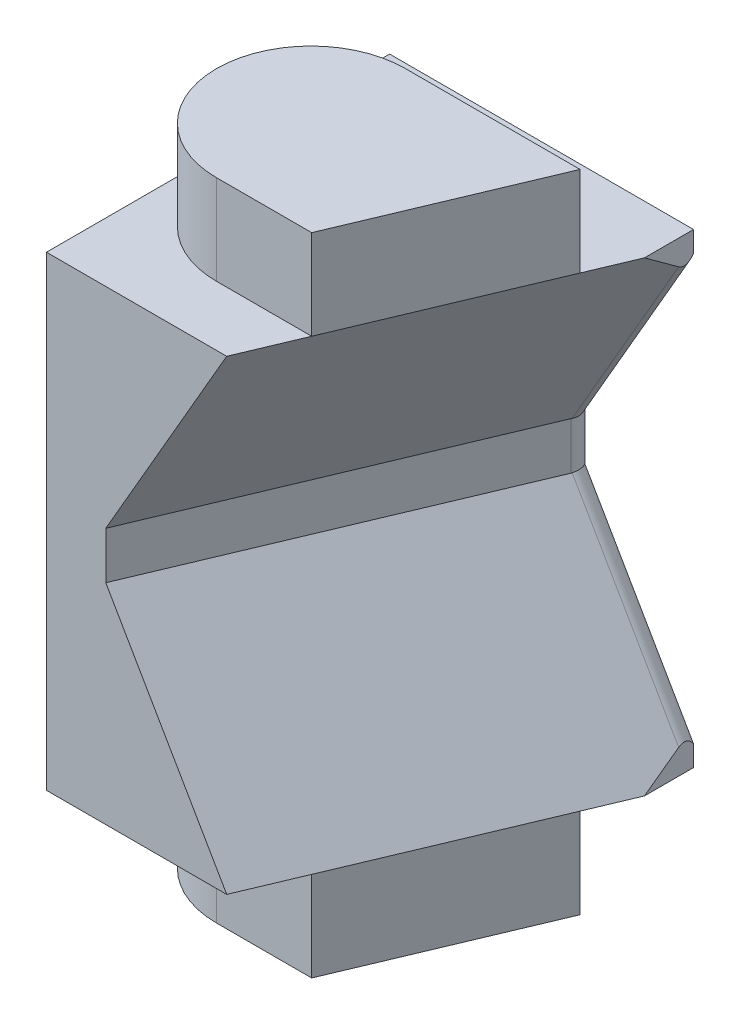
ISO-10303-21;
HEADER;
FILE_DESCRIPTION(('STEP AP214'),'2;1');
FILE_NAME('part.step','',(''),(''),'','','');
FILE_SCHEMA(('AUTOMOTIVE_DESIGN { 1 0 10303 214 1 1 1 1 }'));
ENDSEC;
DATA;
#1=APPLICATION_CONTEXT('core data for automotive mechanical design processes');
#2=APPLICATION_PROTOCOL_DEFINITION('international standard','automotive_design',2000,#1);
#3=PRODUCT_CONTEXT('',#1,'mechanical');
#4=PRODUCT('Part','Part','',(#3));
#5=PRODUCT_RELATED_PRODUCT_CATEGORY('part','',(#4));
#6=PRODUCT_DEFINITION_FORMATION('','',#4);
#7=PRODUCT_DEFINITION_CONTEXT('part definition',#1,'design');
#8=PRODUCT_DEFINITION('design','',#6,#7);
#9=PRODUCT_DEFINITION_SHAPE('','',#8);
#10=(LENGTH_UNIT() NAMED_UNIT(*) SI_UNIT(.MILLI.,.METRE.));
#11=(NAMED_UNIT(*) PLANE_ANGLE_UNIT() SI_UNIT($,.RADIAN.));
#12=(NAMED_UNIT(*) SI_UNIT($,.STERADIAN.) SOLID_ANGLE_UNIT());
#13=UNCERTAINTY_MEASURE_WITH_UNIT(LENGTH_MEASURE(1.E-05),#10,'distance_accuracy_value','');
#14=(GEOMETRIC_REPRESENTATION_CONTEXT(3) GLOBAL_UNCERTAINTY_ASSIGNED_CONTEXT((#13)) GLOBAL_UNIT_ASSIGNED_CONTEXT((#10,
#11,#12)) REPRESENTATION_CONTEXT('',''));
#15=CARTESIAN_POINT('',(0.,0.,0.));
#16=DIRECTION('',(0.,0.,1.));
#17=DIRECTION('',(1.,0.,0.));
#18=AXIS2_PLACEMENT_3D('',#15,#16,#17);
#19=CARTESIAN_POINT('',(10.5219452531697,-0.109025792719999,0.6));
#20=DIRECTION('',(-0.5,-0.866025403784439,0.));
#21=DIRECTION('',(-0.866025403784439,0.5,0.));
#22=AXIS2_PLACEMENT_3D('',#19,#20,#21);
#23=CYLINDRICAL_SURFACE('',#22,1.);
#24=DIRECTION('',(-0.5,-0.866025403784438,0.));
#25=VECTOR('',#24,1.);
#26=CARTESIAN_POINT('',(7.510431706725,-7.20450550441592,0.942020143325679));
#27=LINE('',#26,#25);
#28=CARTESIAN_POINT('',(12.5345716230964,1.49756009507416,0.942020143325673));
#29=VERTEX_POINT('',#28);
#30=CARTESIAN_POINT('',(19.3,13.2156257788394,0.942020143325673));
#31=VERTEX_POINT('',#30);
#32=EDGE_CURVE('E300',#29,#31,#27,.F.);
#33=ORIENTED_EDGE('',*,*,#32,.F.);
#34=CARTESIAN_POINT('',(11.5948790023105,1.74934997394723,0.6));
#35=DIRECTION('',(-0.258819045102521,-0.965925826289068,0.));
#36=DIRECTION('',(-0.965925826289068,0.258819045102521,0.));
#37=AXIS2_PLACEMENT_3D('',#34,#35,#36);
#38=ELLIPSE('',#37,1.03527618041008,1.);
#39=CARTESIAN_POINT('',(12.3948790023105,1.53499062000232,0.));
#40=VERTEX_POINT('',#39);
#41=EDGE_CURVE('E211',#40,#29,#38,.T.);
#42=ORIENTED_EDGE('',*,*,#41,.F.);
#43=DIRECTION('',(-0.5,-0.866025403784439,0.));
#44=VECTOR('',#43,1.);
#45=CARTESIAN_POINT('',(19.3,13.4950110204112,0.));
#46=LINE('',#45,#44);
#47=CARTESIAN_POINT('',(19.3,13.4950110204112,0.));
#48=VERTEX_POINT('',#47);
#49=EDGE_CURVE('E248',#48,#40,#46,.T.);
#50=ORIENTED_EDGE('',*,*,#49,.F.);
#51=CARTESIAN_POINT('',(19.3,15.0950110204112,0.6));
#52=DIRECTION('',(1.,0.,0.));
#53=DIRECTION('',(0.,-1.,0.));
#54=AXIS2_PLACEMENT_3D('',#51,#52,#53);
#55=ELLIPSE('',#54,2.,1.);
#56=EDGE_CURVE('E284',#31,#48,#55,.T.);
#57=ORIENTED_EDGE('',*,*,#56,.F.);
#58=EDGE_LOOP('',(#33,#42,#50,#57));
#59=FACE_BOUND('',#58,.T.);
#60=ADVANCED_FACE('F14',(#59),#23,.T.);
#61=CARTESIAN_POINT('',(11.5948790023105,3.325,0.6));
#62=DIRECTION('',(0.,-1.,0.));
#63=DIRECTION('',(-1.,0.,0.));
#64=AXIS2_PLACEMENT_3D('',#61,#62,#63);
#65=CYLINDRICAL_SURFACE('',#64,1.);
#66=CARTESIAN_POINT('',(11.5948790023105,0.379005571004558,0.6));
#67=DIRECTION('',(0.813797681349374,0.469846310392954,0.342020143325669));
#68=DIRECTION('',(0.433147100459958,-0.882748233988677,0.182041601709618));
#69=AXIS2_PLACEMENT_3D('',#66,#67,#68);
#70=ELLIPSE('',#69,2.12835554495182,1.);
#71=CARTESIAN_POINT('',(12.5345716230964,-1.49756009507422,0.942020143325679));
#72=VERTEX_POINT('',#71);
#73=CARTESIAN_POINT('',(12.516742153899,-1.49979652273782,0.987515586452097));
#74=VERTEX_POINT('',#73);
#75=EDGE_CURVE('E267',#72,#74,#70,.F.);
#76=ORIENTED_EDGE('',*,*,#75,.F.);
#77=CARTESIAN_POINT('',(11.5948790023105,-1.7493499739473,0.6));
#78=DIRECTION('',(0.258819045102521,-0.965925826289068,0.));
#79=DIRECTION('',(-0.965925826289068,-0.258819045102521,0.));
#80=AXIS2_PLACEMENT_3D('',#77,#78,#79);
#81=ELLIPSE('',#80,1.03527618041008,1.);
#82=CARTESIAN_POINT('',(12.3948790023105,-1.53499062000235,0.));
#83=VERTEX_POINT('',#82);
#84=EDGE_CURVE('E282',#83,#72,#81,.T.);
#85=ORIENTED_EDGE('',*,*,#84,.F.);
#86=DIRECTION('',(0.,1.,0.));
#87=VECTOR('',#86,1.);
#88=CARTESIAN_POINT('',(12.3948790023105,0.,0.));
#89=LINE('',#88,#87);
#90=EDGE_CURVE('E233',#40,#83,#89,.F.);
#91=ORIENTED_EDGE('',*,*,#90,.F.);
#92=ORIENTED_EDGE('',*,*,#41,.T.);
#93=CARTESIAN_POINT('',(11.5948790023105,-0.379005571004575,0.6));
#94=DIRECTION('',(0.813797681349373,-0.469846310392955,0.342020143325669));
#95=DIRECTION('',(-0.433147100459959,-0.882748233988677,-0.182041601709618));
#96=AXIS2_PLACEMENT_3D('',#93,#94,#95);
#97=ELLIPSE('',#96,2.12835554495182,1.);
#98=CARTESIAN_POINT('',(12.516742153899,1.49979652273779,0.987515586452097));
#99=VERTEX_POINT('',#98);
#100=EDGE_CURVE('E286',#99,#29,#97,.F.);
#101=ORIENTED_EDGE('',*,*,#100,.F.);
#102=DIRECTION('',(0.,-1.,0.));
#103=VECTOR('',#102,1.);
#104=CARTESIAN_POINT('',(12.516742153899,-8.15,0.98751558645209));
#105=LINE('',#104,#103);
#106=EDGE_CURVE('E277',#74,#99,#105,.F.);
#107=ORIENTED_EDGE('',*,*,#106,.F.);
#108=EDGE_LOOP('',(#76,#85,#91,#92,#101,#107));
#109=FACE_BOUND('',#108,.T.);
#110=ADVANCED_FACE('F375',(#109),#65,.T.);
#111=CARTESIAN_POINT('',(8.86765125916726,2.9743470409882,0.6));
#112=DIRECTION('',(0.5,-0.866025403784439,0.));
#113=DIRECTION('',(-0.866025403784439,-0.5,0.));
#114=AXIS2_PLACEMENT_3D('',#111,#112,#113);
#115=CYLINDRICAL_SURFACE('',#114,1.);
#116=DIRECTION('',(0.5,-0.866025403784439,0.));
#117=VECTOR('',#116,1.);
#118=CARTESIAN_POINT('',(17.0190196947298,-9.26485199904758,0.942020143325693));
#119=LINE('',#118,#117);
#120=CARTESIAN_POINT('',(19.3,-13.2156257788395,0.942020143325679));
#121=VERTEX_POINT('',#120);
#122=EDGE_CURVE('E264',#121,#72,#119,.F.);
#123=ORIENTED_EDGE('',*,*,#122,.F.);
#124=CARTESIAN_POINT('',(19.3,-15.0950110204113,0.6));
#125=DIRECTION('',(1.,0.,0.));
#126=DIRECTION('',(0.,-1.,0.));
#127=AXIS2_PLACEMENT_3D('',#124,#125,#126);
#128=ELLIPSE('',#127,2.,1.);
#129=CARTESIAN_POINT('',(19.3,-13.4950110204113,0.));
#130=VERTEX_POINT('',#129);
#131=EDGE_CURVE('E268',#130,#121,#128,.T.);
#132=ORIENTED_EDGE('',*,*,#131,.F.);
#133=DIRECTION('',(0.5,-0.86602540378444,0.));
#134=VECTOR('',#133,1.);
#135=CARTESIAN_POINT('',(12.3948790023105,-1.5349906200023,0.));
#136=LINE('',#135,#134);
#137=EDGE_CURVE('E230',#83,#130,#136,.T.);
#138=ORIENTED_EDGE('',*,*,#137,.F.);
#139=ORIENTED_EDGE('',*,*,#84,.T.);
#140=EDGE_LOOP('',(#123,#132,#138,#139));
#141=FACE_BOUND('',#140,.T.);
#142=ADVANCED_FACE('F382',(#141),#115,.T.);
#143=CARTESIAN_POINT('',(19.3,0.,10.7));
#144=DIRECTION('',(1.,0.,0.));
#145=DIRECTION('',(0.,-1.,0.));
#146=AXIS2_PLACEMENT_3D('',#143,#144,#145);
#147=PLANE('',#146);
#148=DIRECTION('',(0.,0.588524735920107,0.808479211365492));
#149=VECTOR('',#148,1.);
#150=CARTESIAN_POINT('',(19.3,13.2156257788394,0.942020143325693));
#151=LINE('',#150,#149);
#152=CARTESIAN_POINT('',(19.3,14.8,3.118536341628));
#153=VERTEX_POINT('',#152);
#154=EDGE_CURVE('E297',#31,#153,#151,.T.);
#155=ORIENTED_EDGE('',*,*,#154,.F.);
#156=ORIENTED_EDGE('',*,*,#56,.T.);
#157=DIRECTION('',(0.,1.,0.));
#158=VECTOR('',#157,1.);
#159=CARTESIAN_POINT('',(19.3,0.,0.));
#160=LINE('',#159,#158);
#161=CARTESIAN_POINT('',(19.3,14.8,0.));
#162=VERTEX_POINT('',#161);
#163=EDGE_CURVE('E250',#162,#48,#160,.F.);
#164=ORIENTED_EDGE('',*,*,#163,.F.);
#165=DIRECTION('',(0.,0.,-1.));
#166=VECTOR('',#165,1.);
#167=CARTESIAN_POINT('',(19.3,14.8,21.8));
#168=LINE('',#167,#166);
#169=EDGE_CURVE('E229',#153,#162,#168,.T.);
#170=ORIENTED_EDGE('',*,*,#169,.F.);
#171=EDGE_LOOP('',(#155,#156,#164,#170));
#172=FACE_BOUND('',#171,.T.);
#173=ADVANCED_FACE('F438',(#172),#147,.T.);
#174=CARTESIAN_POINT('',(8.43398964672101,-8.15,10.7));
#175=DIRECTION('',(0.921863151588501,0.,0.387515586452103));
#176=DIRECTION('',(-0.387515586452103,0.,0.921863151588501));
#177=AXIS2_PLACEMENT_3D('',#174,#175,#176);
#178=PLANE('',#177);
#179=DIRECTION('',(0.,-1.,0.));
#180=VECTOR('',#179,1.);
#181=CARTESIAN_POINT('',(3.76797929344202,-14.8,21.8));
#182=LINE('',#181,#180);
#183=CARTESIAN_POINT('',(3.76797929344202,-1.49674440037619,21.8));
#184=VERTEX_POINT('',#183);
#185=CARTESIAN_POINT('',(3.767979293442,1.49674440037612,21.8));
#186=VERTEX_POINT('',#185);
#187=EDGE_CURVE('E228',#184,#186,#182,.F.);
#188=ORIENTED_EDGE('',*,*,#187,.F.);
#189=DIRECTION('',(-0.387515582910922,0.000135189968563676,0.921863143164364));
#190=VECTOR('',#189,1.);
#191=CARTESIAN_POINT('',(12.516742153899,-1.49979652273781,0.98751558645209));
#192=LINE('',#191,#190);
#193=EDGE_CURVE('E271',#74,#184,#192,.T.);
#194=ORIENTED_EDGE('',*,*,#193,.F.);
#195=ORIENTED_EDGE('',*,*,#106,.T.);
#196=DIRECTION('',(0.387515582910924,0.000135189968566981,-0.921863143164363));
#197=VECTOR('',#196,1.);
#198=CARTESIAN_POINT('',(3.767979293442,1.49674440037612,21.8));
#199=LINE('',#198,#197);
#200=EDGE_CURVE('E289',#186,#99,#199,.T.);
#201=ORIENTED_EDGE('',*,*,#200,.F.);
#202=EDGE_LOOP('',(#188,#194,#195,#201));
#203=FACE_BOUND('',#202,.T.);
#204=ADVANCED_FACE('F325',(#203),#178,.T.);
#205=CARTESIAN_POINT('',(4.43464357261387,-5.4286983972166,10.7));
#206=DIRECTION('',(0.813797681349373,-0.469846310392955,0.342020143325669));
#207=DIRECTION('',(-0.5,-0.866025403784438,0.));
#208=AXIS2_PLACEMENT_3D('',#205,#206,#207);
#209=PLANE('',#208);
#210=ORIENTED_EDGE('',*,*,#200,.T.);
#211=ORIENTED_EDGE('',*,*,#100,.T.);
#212=ORIENTED_EDGE('',*,*,#32,.T.);
#213=ORIENTED_EDGE('',*,*,#154,.T.);
#214=DIRECTION('',(0.387449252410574,0.,-0.921891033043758));
#215=VECTOR('',#214,1.);
#216=CARTESIAN_POINT('',(11.4486174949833,14.8,21.8));
#217=LINE('',#216,#215);
#218=CARTESIAN_POINT('',(18.0889881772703,14.8,6.));
#219=VERTEX_POINT('',#218);
#220=EDGE_CURVE('E18',#219,#153,#217,.T.);
#221=ORIENTED_EDGE('',*,*,#220,.F.);
#222=DIRECTION('',(-0.387449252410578,0.,0.921891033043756));
#223=VECTOR('',#222,1.);
#224=CARTESIAN_POINT('',(13.0456686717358,14.8,18.));
#225=LINE('',#224,#223);
#226=CARTESIAN_POINT('',(13.0456686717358,14.8,18.));
#227=VERTEX_POINT('',#226);
#228=EDGE_CURVE('E175',#219,#227,#225,.T.);
#229=ORIENTED_EDGE('',*,*,#228,.T.);
#230=CARTESIAN_POINT('',(11.4486174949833,14.8,21.8));
#231=VERTEX_POINT('',#230);
#232=EDGE_CURVE('E258',#231,#227,#217,.T.);
#233=ORIENTED_EDGE('',*,*,#232,.F.);
#234=DIRECTION('',(0.5,0.866025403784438,0.));
#235=VECTOR('',#234,1.);
#236=CARTESIAN_POINT('',(3.76797929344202,1.4967444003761,21.8));
#237=LINE('',#236,#235);
#238=EDGE_CURVE('E224',#186,#231,#237,.T.);
#239=ORIENTED_EDGE('',*,*,#238,.F.);
#240=EDGE_LOOP('',(#210,#211,#212,#213,#221,#229,#233,#239));
#241=FACE_BOUND('',#240,.T.);
#242=ADVANCED_FACE('F330',(#241),#209,.T.);
#243=CARTESIAN_POINT('',(19.3,0.,10.7));
#244=DIRECTION('',(1.,0.,0.));
#245=DIRECTION('',(0.,-1.,0.));
#246=AXIS2_PLACEMENT_3D('',#243,#244,#245);
#247=PLANE('',#246);
#248=DIRECTION('',(0.,0.588524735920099,-0.808479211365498));
#249=VECTOR('',#248,1.);
#250=CARTESIAN_POINT('',(19.3,-14.8,3.11853634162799));
#251=LINE('',#250,#249);
#252=CARTESIAN_POINT('',(19.3,-14.8,3.11853634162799));
#253=VERTEX_POINT('',#252);
#254=EDGE_CURVE('E253',#253,#121,#251,.T.);
#255=ORIENTED_EDGE('',*,*,#254,.F.);
#256=DIRECTION('',(0.,0.,-1.));
#257=VECTOR('',#256,1.);
#258=CARTESIAN_POINT('',(19.3,-14.8,-0.4));
#259=LINE('',#258,#257);
#260=CARTESIAN_POINT('',(19.3,-14.8,0.));
#261=VERTEX_POINT('',#260);
#262=EDGE_CURVE('E240',#261,#253,#259,.F.);
#263=ORIENTED_EDGE('',*,*,#262,.F.);
#264=DIRECTION('',(0.,1.,0.));
#265=VECTOR('',#264,1.);
#266=CARTESIAN_POINT('',(19.3,0.,0.));
#267=LINE('',#266,#265);
#268=EDGE_CURVE('E232',#130,#261,#267,.F.);
#269=ORIENTED_EDGE('',*,*,#268,.F.);
#270=ORIENTED_EDGE('',*,*,#131,.T.);
#271=EDGE_LOOP('',(#255,#263,#269,#270));
#272=FACE_BOUND('',#271,.T.);
#273=ADVANCED_FACE('F431',(#272),#247,.T.);
#274=CARTESIAN_POINT('',(13.9432315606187,-11.0406591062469,10.7));
#275=DIRECTION('',(0.813797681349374,0.469846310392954,0.342020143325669));
#276=DIRECTION('',(0.5,-0.866025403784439,0.));
#277=AXIS2_PLACEMENT_3D('',#274,#275,#276);
#278=PLANE('',#277);
#279=DIRECTION('',(-0.387449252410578,0.,0.921891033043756));
#280=VECTOR('',#279,1.);
#281=CARTESIAN_POINT('',(19.3,-14.8,3.118536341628));
#282=LINE('',#281,#280);
#283=CARTESIAN_POINT('',(18.0889881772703,-14.8,6.));
#284=VERTEX_POINT('',#283);
#285=EDGE_CURVE('E219',#253,#284,#282,.T.);
#286=ORIENTED_EDGE('',*,*,#285,.F.);
#287=ORIENTED_EDGE('',*,*,#254,.T.);
#288=ORIENTED_EDGE('',*,*,#122,.T.);
#289=ORIENTED_EDGE('',*,*,#75,.T.);
#290=ORIENTED_EDGE('',*,*,#193,.T.);
#291=DIRECTION('',(-0.5,0.866025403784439,0.));
#292=VECTOR('',#291,1.);
#293=CARTESIAN_POINT('',(11.4486174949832,-14.8,21.8));
#294=LINE('',#293,#292);
#295=CARTESIAN_POINT('',(11.4486174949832,-14.8,21.8));
#296=VERTEX_POINT('',#295);
#297=EDGE_CURVE('E225',#296,#184,#294,.T.);
#298=ORIENTED_EDGE('',*,*,#297,.F.);
#299=CARTESIAN_POINT('',(13.0456686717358,-14.8,18.));
#300=VERTEX_POINT('',#299);
#301=EDGE_CURVE('E244',#300,#296,#282,.T.);
#302=ORIENTED_EDGE('',*,*,#301,.F.);
#303=DIRECTION('',(0.387449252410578,0.,-0.921891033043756));
#304=VECTOR('',#303,1.);
#305=CARTESIAN_POINT('',(18.0889881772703,-14.8,6.));
#306=LINE('',#305,#304);
#307=EDGE_CURVE('E181',#300,#284,#306,.T.);
#308=ORIENTED_EDGE('',*,*,#307,.T.);
#309=EDGE_LOOP('',(#286,#287,#288,#289,#290,#298,#302,#308));
#310=FACE_BOUND('',#309,.T.);
#311=ADVANCED_FACE('F315',(#310),#278,.T.);
#312=CARTESIAN_POINT('',(9.36592994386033,0.,0.));
#313=DIRECTION('',(0.,0.,-1.));
#314=DIRECTION('',(0.,1.,0.));
#315=AXIS2_PLACEMENT_3D('',#312,#313,#314);
#316=PLANE('',#315);
#317=ORIENTED_EDGE('',*,*,#268,.T.);
#318=DIRECTION('',(-1.,0.,0.));
#319=VECTOR('',#318,1.);
#320=CARTESIAN_POINT('',(0.,-14.8,0.));
#321=LINE('',#320,#319);
#322=CARTESIAN_POINT('',(0.,-14.8,0.));
#323=VERTEX_POINT('',#322);
#324=EDGE_CURVE('E223',#323,#261,#321,.F.);
#325=ORIENTED_EDGE('',*,*,#324,.F.);
#326=DIRECTION('',(0.,1.,0.));
#327=VECTOR('',#326,1.);
#328=CARTESIAN_POINT('',(0.,-16.2327616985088,0.));
#329=LINE('',#328,#327);
#330=CARTESIAN_POINT('',(0.,14.8,0.));
#331=VERTEX_POINT('',#330);
#332=EDGE_CURVE('E209',#323,#331,#329,.T.);
#333=ORIENTED_EDGE('',*,*,#332,.T.);
#334=DIRECTION('',(1.,0.,0.));
#335=VECTOR('',#334,1.);
#336=CARTESIAN_POINT('',(0.,14.8,0.));
#337=LINE('',#336,#335);
#338=EDGE_CURVE('E236',#162,#331,#337,.F.);
#339=ORIENTED_EDGE('',*,*,#338,.F.);
#340=ORIENTED_EDGE('',*,*,#163,.T.);
#341=ORIENTED_EDGE('',*,*,#49,.T.);
#342=ORIENTED_EDGE('',*,*,#90,.T.);
#343=ORIENTED_EDGE('',*,*,#137,.T.);
#344=EDGE_LOOP('',(#317,#325,#333,#339,#340,#341,#342,#343));
#345=FACE_BOUND('',#344,.T.);
#346=ADVANCED_FACE('F423',(#345),#316,.T.);
#347=CARTESIAN_POINT('',(0.,14.8,21.8));
#348=DIRECTION('',(0.,1.,0.));
#349=DIRECTION('',(1.,0.,0.));
#350=AXIS2_PLACEMENT_3D('',#347,#348,#349);
#351=PLANE('',#350);
#352=DIRECTION('',(1.,0.,0.));
#353=VECTOR('',#352,1.);
#354=CARTESIAN_POINT('',(7.,14.8,6.));
#355=LINE('',#354,#353);
#356=CARTESIAN_POINT('',(7.,14.8,6.));
#357=VERTEX_POINT('',#356);
#358=EDGE_CURVE('E413',#357,#219,#355,.T.);
#359=ORIENTED_EDGE('',*,*,#358,.T.);
#360=ORIENTED_EDGE('',*,*,#220,.T.);
#361=ORIENTED_EDGE('',*,*,#169,.T.);
#362=ORIENTED_EDGE('',*,*,#338,.T.);
#363=DIRECTION('',(0.,0.,-1.));
#364=VECTOR('',#363,1.);
#365=CARTESIAN_POINT('',(0.,14.8,10.7));
#366=LINE('',#365,#364);
#367=CARTESIAN_POINT('',(0.,14.8,21.8));
#368=VERTEX_POINT('',#367);
#369=EDGE_CURVE('E215',#331,#368,#366,.F.);
#370=ORIENTED_EDGE('',*,*,#369,.T.);
#371=DIRECTION('',(-1.,0.,0.));
#372=VECTOR('',#371,1.);
#373=CARTESIAN_POINT('',(0.,14.8,21.8));
#374=LINE('',#373,#372);
#375=EDGE_CURVE('E220',#231,#368,#374,.T.);
#376=ORIENTED_EDGE('',*,*,#375,.F.);
#377=ORIENTED_EDGE('',*,*,#232,.T.);
#378=DIRECTION('',(-1.,0.,0.));
#379=VECTOR('',#378,1.);
#380=CARTESIAN_POINT('',(7.,14.8,18.));
#381=LINE('',#380,#379);
#382=CARTESIAN_POINT('',(7.,14.8,18.));
#383=VERTEX_POINT('',#382);
#384=EDGE_CURVE('E37',#227,#383,#381,.T.);
#385=ORIENTED_EDGE('',*,*,#384,.T.);
#386=CARTESIAN_POINT('',(7.,14.8,12.));
#387=DIRECTION('',(0.,1.,0.));
#388=DIRECTION('',(0.,0.,-1.));
#389=AXIS2_PLACEMENT_3D('',#386,#387,#388);
#390=CIRCLE('',#389,6.);
#391=EDGE_CURVE('E32',#383,#357,#390,.F.);
#392=ORIENTED_EDGE('',*,*,#391,.T.);
#393=EDGE_LOOP('',(#359,#360,#361,#362,#370,#376,#377,#385,#392));
#394=FACE_BOUND('',#393,.T.);
#395=ADVANCED_FACE('F419',(#394),#351,.T.);
#396=CARTESIAN_POINT('',(0.,-14.8,21.8));
#397=DIRECTION('',(0.,0.,1.));
#398=DIRECTION('',(-1.,0.,0.));
#399=AXIS2_PLACEMENT_3D('',#396,#397,#398);
#400=PLANE('',#399);
#401=DIRECTION('',(0.,-1.,0.));
#402=VECTOR('',#401,1.);
#403=CARTESIAN_POINT('',(0.,0.,21.8));
#404=LINE('',#403,#402);
#405=CARTESIAN_POINT('',(0.,-14.8,21.8));
#406=VERTEX_POINT('',#405);
#407=EDGE_CURVE('E24',#368,#406,#404,.T.);
#408=ORIENTED_EDGE('',*,*,#407,.T.);
#409=DIRECTION('',(-1.,0.,0.));
#410=VECTOR('',#409,1.);
#411=CARTESIAN_POINT('',(0.,-14.8,21.8));
#412=LINE('',#411,#410);
#413=EDGE_CURVE('E217',#296,#406,#412,.T.);
#414=ORIENTED_EDGE('',*,*,#413,.F.);
#415=ORIENTED_EDGE('',*,*,#297,.T.);
#416=ORIENTED_EDGE('',*,*,#187,.T.);
#417=ORIENTED_EDGE('',*,*,#238,.T.);
#418=ORIENTED_EDGE('',*,*,#375,.T.);
#419=EDGE_LOOP('',(#408,#414,#415,#416,#417,#418));
#420=FACE_BOUND('',#419,.T.);
#421=ADVANCED_FACE('F323',(#420),#400,.T.);
#422=CARTESIAN_POINT('',(0.,-14.8,-0.4));
#423=DIRECTION('',(0.,-1.,0.));
#424=DIRECTION('',(-1.,0.,0.));
#425=AXIS2_PLACEMENT_3D('',#422,#423,#424);
#426=PLANE('',#425);
#427=DIRECTION('',(1.,0.,0.));
#428=VECTOR('',#427,1.);
#429=CARTESIAN_POINT('',(7.,-14.8,18.));
#430=LINE('',#429,#428);
#431=CARTESIAN_POINT('',(7.,-14.8,18.));
#432=VERTEX_POINT('',#431);
#433=EDGE_CURVE('E184',#432,#300,#430,.T.);
#434=ORIENTED_EDGE('',*,*,#433,.T.);
#435=ORIENTED_EDGE('',*,*,#301,.T.);
#436=ORIENTED_EDGE('',*,*,#413,.T.);
#437=DIRECTION('',(0.,0.,-1.));
#438=VECTOR('',#437,1.);
#439=CARTESIAN_POINT('',(0.,-14.8,10.7));
#440=LINE('',#439,#438);
#441=EDGE_CURVE('E9',#406,#323,#440,.T.);
#442=ORIENTED_EDGE('',*,*,#441,.T.);
#443=ORIENTED_EDGE('',*,*,#324,.T.);
#444=ORIENTED_EDGE('',*,*,#262,.T.);
#445=ORIENTED_EDGE('',*,*,#285,.T.);
#446=DIRECTION('',(-1.,0.,0.));
#447=VECTOR('',#446,1.);
#448=CARTESIAN_POINT('',(7.,-14.8,6.));
#449=LINE('',#448,#447);
#450=CARTESIAN_POINT('',(7.,-14.8,6.));
#451=VERTEX_POINT('',#450);
#452=EDGE_CURVE('E189',#284,#451,#449,.T.);
#453=ORIENTED_EDGE('',*,*,#452,.T.);
#454=CARTESIAN_POINT('',(7.,-14.8,12.));
#455=DIRECTION('',(0.,-1.,0.));
#456=DIRECTION('',(0.,0.,1.));
#457=AXIS2_PLACEMENT_3D('',#454,#455,#456);
#458=CIRCLE('',#457,6.);
#459=EDGE_CURVE('E187',#451,#432,#458,.F.);
#460=ORIENTED_EDGE('',*,*,#459,.T.);
#461=EDGE_LOOP('',(#434,#435,#436,#442,#443,#444,#445,#453,#460));
#462=FACE_BOUND('',#461,.T.);
#463=ADVANCED_FACE('F340',(#462),#426,.T.);
#464=CARTESIAN_POINT('',(0.,0.,10.7));
#465=DIRECTION('',(1.,0.,0.));
#466=DIRECTION('',(0.,-1.,0.));
#467=AXIS2_PLACEMENT_3D('',#464,#465,#466);
#468=PLANE('',#467);
#469=ORIENTED_EDGE('',*,*,#407,.F.);
#470=ORIENTED_EDGE('',*,*,#369,.F.);
#471=ORIENTED_EDGE('',*,*,#332,.F.);
#472=ORIENTED_EDGE('',*,*,#441,.F.);
#473=EDGE_LOOP('',(#469,#470,#471,#472));
#474=FACE_BOUND('',#473,.T.);
#475=ADVANCED_FACE('F337',(#474),#468,.F.);
#476=CARTESIAN_POINT('',(7.,6.08141558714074,12.));
#477=DIRECTION('',(0.,-1.,0.));
#478=DIRECTION('',(1.,0.,0.));
#479=AXIS2_PLACEMENT_3D('',#476,#477,#478);
#480=CYLINDRICAL_SURFACE('',#479,6.);
#481=ORIENTED_EDGE('',*,*,#459,.F.);
#482=DIRECTION('',(0.,-1.,0.));
#483=VECTOR('',#482,1.);
#484=CARTESIAN_POINT('',(7.,6.08141558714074,6.));
#485=LINE('',#484,#483);
#486=CARTESIAN_POINT('',(7.,-20.5,6.));
#487=VERTEX_POINT('',#486);
#488=EDGE_CURVE('E201',#451,#487,#485,.T.);
#489=ORIENTED_EDGE('',*,*,#488,.T.);
#490=CARTESIAN_POINT('',(7.,-20.5,12.));
#491=DIRECTION('',(0.,-1.,0.));
#492=DIRECTION('',(1.,0.,0.));
#493=AXIS2_PLACEMENT_3D('',#490,#491,#492);
#494=CIRCLE('',#493,6.);
#495=CARTESIAN_POINT('',(7.,-20.5,18.));
#496=VERTEX_POINT('',#495);
#497=EDGE_CURVE('E180',#496,#487,#494,.T.);
#498=ORIENTED_EDGE('',*,*,#497,.F.);
#499=DIRECTION('',(0.,-1.,0.));
#500=VECTOR('',#499,1.);
#501=CARTESIAN_POINT('',(7.,6.08141558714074,18.));
#502=LINE('',#501,#500);
#503=EDGE_CURVE('E185',#432,#496,#502,.T.);
#504=ORIENTED_EDGE('',*,*,#503,.F.);
#505=EDGE_LOOP('',(#481,#489,#498,#504));
#506=FACE_BOUND('',#505,.T.);
#507=ADVANCED_FACE('F362',(#506),#480,.T.);
#508=CARTESIAN_POINT('',(7.,6.08141558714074,18.));
#509=DIRECTION('',(0.,0.,1.));
#510=DIRECTION('',(0.,1.,0.));
#511=AXIS2_PLACEMENT_3D('',#508,#509,#510);
#512=PLANE('',#511);
#513=ORIENTED_EDGE('',*,*,#433,.F.);
#514=ORIENTED_EDGE('',*,*,#503,.T.);
#515=DIRECTION('',(-1.,0.,0.));
#516=VECTOR('',#515,1.);
#517=CARTESIAN_POINT('',(7.,-20.5,18.));
#518=LINE('',#517,#516);
#519=CARTESIAN_POINT('',(13.0456686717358,-20.5,18.));
#520=VERTEX_POINT('',#519);
#521=EDGE_CURVE('E198',#520,#496,#518,.T.);
#522=ORIENTED_EDGE('',*,*,#521,.F.);
#523=DIRECTION('',(0.,-1.,0.));
#524=VECTOR('',#523,1.);
#525=CARTESIAN_POINT('',(13.0456686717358,6.08141558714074,18.));
#526=LINE('',#525,#524);
#527=EDGE_CURVE('E203',#300,#520,#526,.T.);
#528=ORIENTED_EDGE('',*,*,#527,.F.);
#529=EDGE_LOOP('',(#513,#514,#522,#528));
#530=FACE_BOUND('',#529,.T.);
#531=ADVANCED_FACE('F351',(#530),#512,.T.);
#532=CARTESIAN_POINT('',(18.0889881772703,6.08141558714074,6.));
#533=DIRECTION('',(0.921891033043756,0.,0.387449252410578));
#534=DIRECTION('',(-0.387449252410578,0.,0.921891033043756));
#535=AXIS2_PLACEMENT_3D('',#532,#533,#534);
#536=PLANE('',#535);
#537=ORIENTED_EDGE('',*,*,#307,.F.);
#538=ORIENTED_EDGE('',*,*,#527,.T.);
#539=DIRECTION('',(-0.387449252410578,0.,0.921891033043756));
#540=VECTOR('',#539,1.);
#541=CARTESIAN_POINT('',(18.0889881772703,-20.5,6.));
#542=LINE('',#541,#540);
#543=CARTESIAN_POINT('',(18.0889881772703,-20.5,6.));
#544=VERTEX_POINT('',#543);
#545=EDGE_CURVE('E195',#544,#520,#542,.T.);
#546=ORIENTED_EDGE('',*,*,#545,.F.);
#547=DIRECTION('',(0.,-1.,0.));
#548=VECTOR('',#547,1.);
#549=CARTESIAN_POINT('',(18.0889881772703,6.08141558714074,6.));
#550=LINE('',#549,#548);
#551=EDGE_CURVE('E205',#284,#544,#550,.T.);
#552=ORIENTED_EDGE('',*,*,#551,.F.);
#553=EDGE_LOOP('',(#537,#538,#546,#552));
#554=FACE_BOUND('',#553,.T.);
#555=ADVANCED_FACE('F346',(#554),#536,.T.);
#556=CARTESIAN_POINT('',(7.,6.08141558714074,6.));
#557=DIRECTION('',(0.,0.,-1.));
#558=DIRECTION('',(0.,-1.,0.));
#559=AXIS2_PLACEMENT_3D('',#556,#557,#558);
#560=PLANE('',#559);
#561=ORIENTED_EDGE('',*,*,#452,.F.);
#562=ORIENTED_EDGE('',*,*,#551,.T.);
#563=DIRECTION('',(1.,0.,0.));
#564=VECTOR('',#563,1.);
#565=CARTESIAN_POINT('',(7.,-20.5,6.));
#566=LINE('',#565,#564);
#567=EDGE_CURVE('E192',#487,#544,#566,.T.);
#568=ORIENTED_EDGE('',*,*,#567,.F.);
#569=ORIENTED_EDGE('',*,*,#488,.F.);
#570=EDGE_LOOP('',(#561,#562,#568,#569));
#571=FACE_BOUND('',#570,.T.);
#572=ADVANCED_FACE('F359',(#571),#560,.T.);
#573=CARTESIAN_POINT('',(7.6545990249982,-20.5,12.));
#574=DIRECTION('',(0.,-1.,0.));
#575=DIRECTION('',(-1.,0.,0.));
#576=AXIS2_PLACEMENT_3D('',#573,#574,#575);
#577=PLANE('',#576);
#578=ORIENTED_EDGE('',*,*,#497,.T.);
#579=ORIENTED_EDGE('',*,*,#567,.T.);
#580=ORIENTED_EDGE('',*,*,#545,.T.);
#581=ORIENTED_EDGE('',*,*,#521,.T.);
#582=EDGE_LOOP('',(#578,#579,#580,#581));
#583=FACE_BOUND('',#582,.T.);
#584=ADVANCED_FACE('F355',(#583),#577,.T.);
#585=CARTESIAN_POINT('',(7.,-6.08141558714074,12.));
#586=DIRECTION('',(0.,1.,0.));
#587=DIRECTION('',(-1.,0.,0.));
#588=AXIS2_PLACEMENT_3D('',#585,#586,#587);
#589=CYLINDRICAL_SURFACE('',#588,6.);
#590=ORIENTED_EDGE('',*,*,#391,.F.);
#591=DIRECTION('',(0.,1.,0.));
#592=VECTOR('',#591,1.);
#593=CARTESIAN_POINT('',(7.,-6.08141558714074,18.));
#594=LINE('',#593,#592);
#595=CARTESIAN_POINT('',(7.,20.5,18.));
#596=VERTEX_POINT('',#595);
#597=EDGE_CURVE('E146',#383,#596,#594,.T.);
#598=ORIENTED_EDGE('',*,*,#597,.T.);
#599=CARTESIAN_POINT('',(7.,20.5,12.));
#600=DIRECTION('',(0.,1.,0.));
#601=DIRECTION('',(-1.,0.,0.));
#602=AXIS2_PLACEMENT_3D('',#599,#600,#601);
#603=CIRCLE('',#602,6.);
#604=CARTESIAN_POINT('',(7.,20.5,6.));
#605=VERTEX_POINT('',#604);
#606=EDGE_CURVE('E151',#605,#596,#603,.T.);
#607=ORIENTED_EDGE('',*,*,#606,.F.);
#608=DIRECTION('',(0.,1.,0.));
#609=VECTOR('',#608,1.);
#610=CARTESIAN_POINT('',(7.,-6.08141558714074,6.));
#611=LINE('',#610,#609);
#612=EDGE_CURVE('E173',#357,#605,#611,.T.);
#613=ORIENTED_EDGE('',*,*,#612,.F.);
#614=EDGE_LOOP('',(#590,#598,#607,#613));
#615=FACE_BOUND('',#614,.T.);
#616=ADVANCED_FACE('F148',(#615),#589,.T.);
#617=CARTESIAN_POINT('',(7.,-6.08141558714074,6.));
#618=DIRECTION('',(0.,0.,-1.));
#619=DIRECTION('',(0.,-1.,0.));
#620=AXIS2_PLACEMENT_3D('',#617,#618,#619);
#621=PLANE('',#620);
#622=ORIENTED_EDGE('',*,*,#358,.F.);
#623=ORIENTED_EDGE('',*,*,#612,.T.);
#624=DIRECTION('',(-1.,0.,0.));
#625=VECTOR('',#624,1.);
#626=CARTESIAN_POINT('',(7.,20.5,6.));
#627=LINE('',#626,#625);
#628=CARTESIAN_POINT('',(18.0889881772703,20.5,6.));
#629=VERTEX_POINT('',#628);
#630=EDGE_CURVE('E155',#629,#605,#627,.T.);
#631=ORIENTED_EDGE('',*,*,#630,.F.);
#632=DIRECTION('',(0.,1.,0.));
#633=VECTOR('',#632,1.);
#634=CARTESIAN_POINT('',(18.0889881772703,-6.08141558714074,6.));
#635=LINE('',#634,#633);
#636=EDGE_CURVE('E176',#219,#629,#635,.T.);
#637=ORIENTED_EDGE('',*,*,#636,.F.);
#638=EDGE_LOOP('',(#622,#623,#631,#637));
#639=FACE_BOUND('',#638,.T.);
#640=ADVANCED_FACE('F393',(#639),#621,.T.);
#641=CARTESIAN_POINT('',(13.0456686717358,-6.08141558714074,18.));
#642=DIRECTION('',(0.921891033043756,0.,0.387449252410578));
#643=DIRECTION('',(-0.387449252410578,0.,0.921891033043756));
#644=AXIS2_PLACEMENT_3D('',#641,#642,#643);
#645=PLANE('',#644);
#646=ORIENTED_EDGE('',*,*,#228,.F.);
#647=ORIENTED_EDGE('',*,*,#636,.T.);
#648=DIRECTION('',(0.387449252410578,0.,-0.921891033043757));
#649=VECTOR('',#648,1.);
#650=CARTESIAN_POINT('',(13.0456686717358,20.5,18.));
#651=LINE('',#650,#649);
#652=CARTESIAN_POINT('',(13.0456686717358,20.5,18.));
#653=VERTEX_POINT('',#652);
#654=EDGE_CURVE('E164',#653,#629,#651,.T.);
#655=ORIENTED_EDGE('',*,*,#654,.F.);
#656=DIRECTION('',(0.,1.,0.));
#657=VECTOR('',#656,1.);
#658=CARTESIAN_POINT('',(13.0456686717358,-6.08141558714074,18.));
#659=LINE('',#658,#657);
#660=EDGE_CURVE('E154',#227,#653,#659,.T.);
#661=ORIENTED_EDGE('',*,*,#660,.F.);
#662=EDGE_LOOP('',(#646,#647,#655,#661));
#663=FACE_BOUND('',#662,.T.);
#664=ADVANCED_FACE('F403',(#663),#645,.T.);
#665=CARTESIAN_POINT('',(7.,-6.08141558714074,18.));
#666=DIRECTION('',(0.,0.,1.));
#667=DIRECTION('',(-1.,0.,0.));
#668=AXIS2_PLACEMENT_3D('',#665,#666,#667);
#669=PLANE('',#668);
#670=ORIENTED_EDGE('',*,*,#384,.F.);
#671=ORIENTED_EDGE('',*,*,#660,.T.);
#672=DIRECTION('',(1.,0.,0.));
#673=VECTOR('',#672,1.);
#674=CARTESIAN_POINT('',(7.,20.5,18.));
#675=LINE('',#674,#673);
#676=EDGE_CURVE('E158',#596,#653,#675,.T.);
#677=ORIENTED_EDGE('',*,*,#676,.F.);
#678=ORIENTED_EDGE('',*,*,#597,.F.);
#679=EDGE_LOOP('',(#670,#671,#677,#678));
#680=FACE_BOUND('',#679,.T.);
#681=ADVANCED_FACE('F159',(#680),#669,.T.);
#682=CARTESIAN_POINT('',(7.6545990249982,20.5,12.));
#683=DIRECTION('',(0.,-1.,0.));
#684=DIRECTION('',(-1.,0.,0.));
#685=AXIS2_PLACEMENT_3D('',#682,#683,#684);
#686=PLANE('',#685);
#687=ORIENTED_EDGE('',*,*,#606,.T.);
#688=ORIENTED_EDGE('',*,*,#676,.T.);
#689=ORIENTED_EDGE('',*,*,#654,.T.);
#690=ORIENTED_EDGE('',*,*,#630,.T.);
#691=EDGE_LOOP('',(#687,#688,#689,#690));
#692=FACE_BOUND('',#691,.T.);
#693=ADVANCED_FACE('F16',(#692),#686,.F.);
#694=CLOSED_SHELL('',(#60,#110,#142,#173,#204,#242,#273,#311,#346,#395,#421,#463,#475,#507,#531,
#555,#572,#584,#616,#640,#664,#681,#693));
#695=MANIFOLD_SOLID_BREP('B1',#694);
#696=ADVANCED_BREP_SHAPE_REPRESENTATION('',(#18,#695),#14);
#697=SHAPE_DEFINITION_REPRESENTATION(#9,#696);
ENDSEC;
END-ISO-10303-21;
